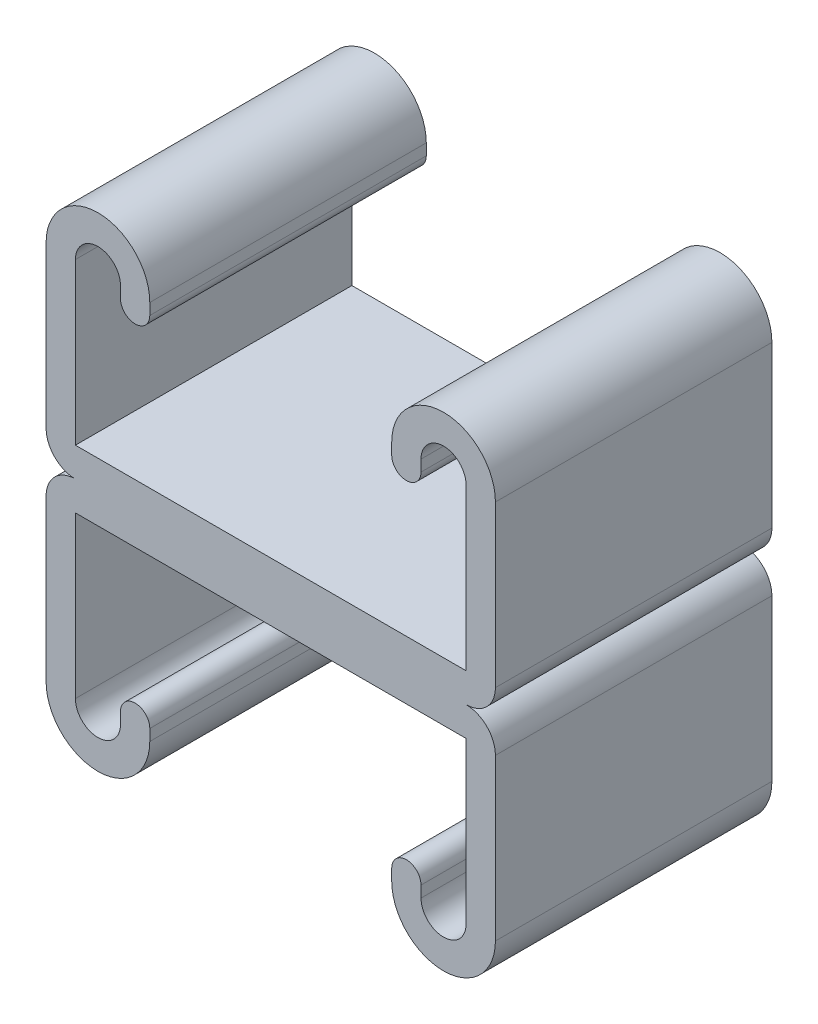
from build123d import *

# Parameters (mm, degrees)
BASE_EXTRUDE_DEPTH = 12.7


with BuildPart() as part:
    # Sketch1 → Base-Extrude (new, symmetric)
    with BuildSketch(Plane.XY):
        with BuildLine():
            Line((-20.6375, 17.4625), (-20.6375, 2.6924))
            ThreePointArc((-20.6375, 2.6924), (-19.848914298, 0.788585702), (-17.9451, 0))
            Line((-17.9451, 0), (17.9451, 0))
            ThreePointArc((17.9451, 0), (19.848914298, 0.788585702), (20.6375, 2.6924))
            Line((20.6375, 2.6924), (20.6375, 17.4625))
            ThreePointArc((20.6375, 17.4625), (15.875, 22.225), (11.1125, 17.4625))
            Line((11.1125, 17.4625), (11.1125, 16.42745))
            ThreePointArc((11.1125, 16.42745), (12.4587, 15.08125), (13.8049, 16.42745))
            Line((13.8049, 16.42745), (13.8049, 17.4625))
            ThreePointArc((13.8049, 17.4625), (15.875, 19.5326), (17.9451, 17.4625))
            Line((17.9451, 17.4625), (17.9451, 2.6924))
            Line((17.9451, 2.6924), (-17.9451, 2.6924))
            Line((-17.9451, 2.6924), (-17.9451, 17.4625))
            ThreePointArc((-17.9451, 17.4625), (-15.875, 19.5326), (-13.8049, 17.4625))
            Line((-13.8049, 17.4625), (-13.8049, 16.42745))
            ThreePointArc((-13.8049, 16.42745), (-12.4587, 15.08125), (-11.1125, 16.42745))
            Line((-11.1125, 16.42745), (-11.1125, 17.4625))
            ThreePointArc((-11.1125, 17.4625), (-15.875, 22.225), (-20.6375, 17.4625))
        make_face()
    base_extrude = extrude(amount=BASE_EXTRUDE_DEPTH, both=True)

    # Mirror1: Base-Extrude across plane
    add(base_extrude.mirror(Plane.ZX))


solid = part.part
